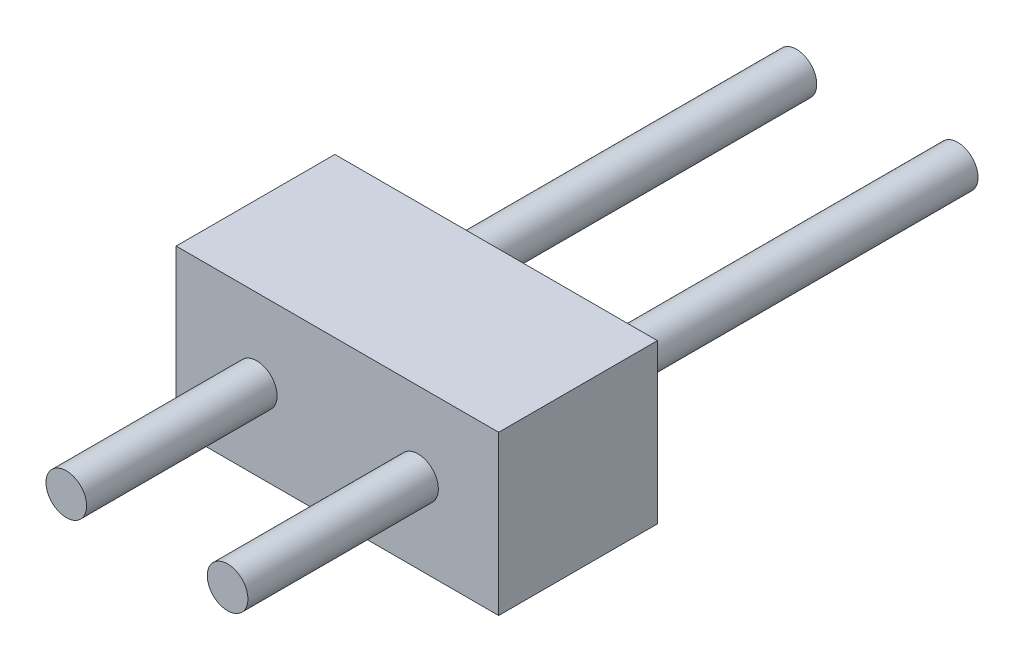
from build123d import *

# Parameters (mm, degrees)
SKETCH1_W           = 5.08
SKETCH1_H           = 2.5
BOSS_EXTRUDE1_DEPTH = 2.5
SKETCH2_R           = 0.32
BOSS_EXTRUDE2_DEPTH = 3
BOSS_EXTRUDE3_START = -8.5
SKETCH2_2_R         = 0.32
BOSS_EXTRUDE3_DEPTH = 6


with BuildPart() as part:
    # Sketch1 → Boss-Extrude1 (new body)
    with BuildSketch(Plane.XY):
        with Locations((2.54, 1.25)):
            Rectangle(SKETCH1_W, SKETCH1_H)
    extrude(amount=BOSS_EXTRUDE1_DEPTH)

    # Sketch2 → Boss-Extrude2 (add)
    with BuildSketch(Plane.XY.offset(2.5)):
        with Locations(Location((1.27, 1.25, 0), (0, 0, 180))):
            Circle(SKETCH2_R)
        with Locations(Location((3.81, 1.25, 0), (0, 0, 180))):
            Circle(SKETCH2_R)
    extrude(amount=BOSS_EXTRUDE2_DEPTH)

    # Sketch2_2 → Boss-Extrude3 (add)
    with BuildSketch(Plane.XY.offset(2.5).offset(BOSS_EXTRUDE3_START)):
        with Locations(Location((1.27, 1.25, 0), (0, 0, 180))):
            Circle(SKETCH2_2_R)
        with Locations(Location((3.81, 1.25, 0), (0, 0, 180))):
            Circle(SKETCH2_2_R)
    extrude(amount=BOSS_EXTRUDE3_DEPTH)


solid = part.part
